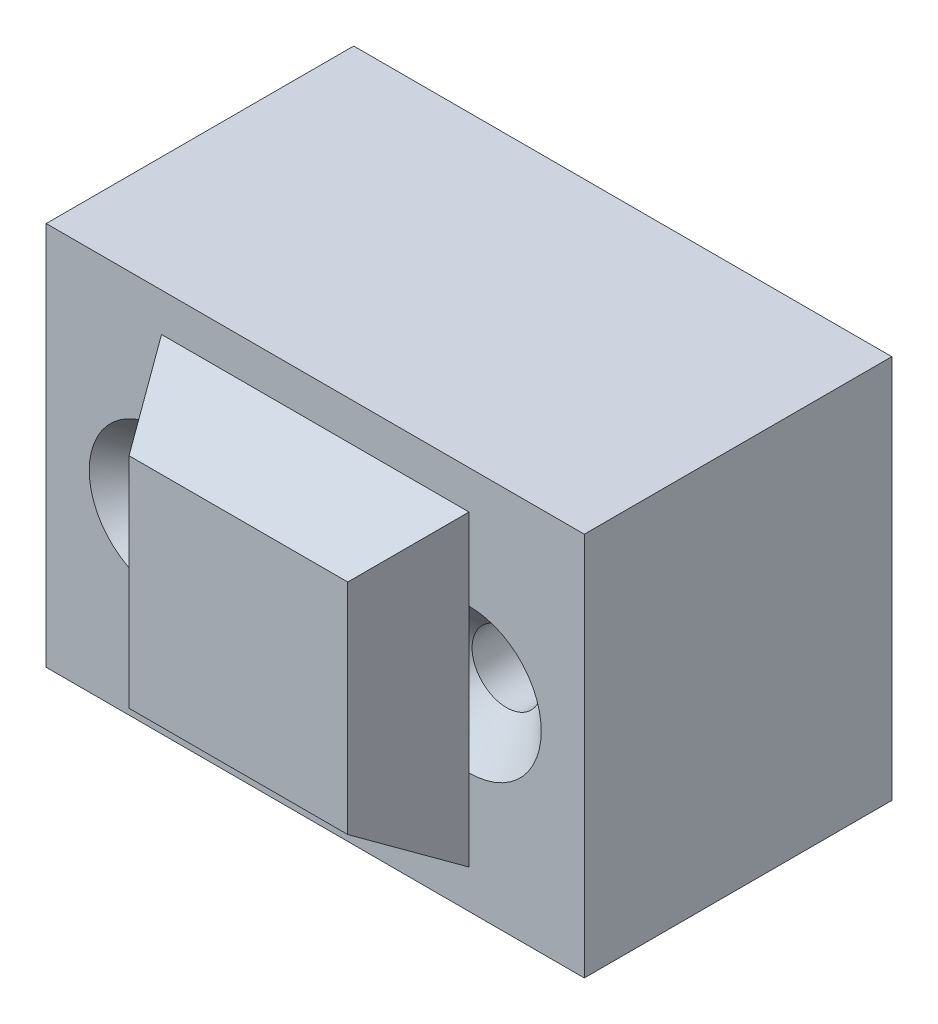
ISO-10303-21;
HEADER;
FILE_DESCRIPTION(('STEP AP214'),'2;1');
FILE_NAME('part.step','',(''),(''),'','','');
FILE_SCHEMA(('AUTOMOTIVE_DESIGN { 1 0 10303 214 1 1 1 1 }'));
ENDSEC;
DATA;
#1=APPLICATION_CONTEXT('core data for automotive mechanical design processes');
#2=APPLICATION_PROTOCOL_DEFINITION('international standard','automotive_design',2000,#1);
#3=PRODUCT_CONTEXT('',#1,'mechanical');
#4=PRODUCT('Part','Part','',(#3));
#5=PRODUCT_RELATED_PRODUCT_CATEGORY('part','',(#4));
#6=PRODUCT_DEFINITION_FORMATION('','',#4);
#7=PRODUCT_DEFINITION_CONTEXT('part definition',#1,'design');
#8=PRODUCT_DEFINITION('design','',#6,#7);
#9=PRODUCT_DEFINITION_SHAPE('','',#8);
#10=(LENGTH_UNIT() NAMED_UNIT(*) SI_UNIT(.MILLI.,.METRE.));
#11=(NAMED_UNIT(*) PLANE_ANGLE_UNIT() SI_UNIT($,.RADIAN.));
#12=(NAMED_UNIT(*) SI_UNIT($,.STERADIAN.) SOLID_ANGLE_UNIT());
#13=UNCERTAINTY_MEASURE_WITH_UNIT(LENGTH_MEASURE(1.E-05),#10,'distance_accuracy_value','');
#14=(GEOMETRIC_REPRESENTATION_CONTEXT(3) GLOBAL_UNCERTAINTY_ASSIGNED_CONTEXT((#13)) GLOBAL_UNIT_ASSIGNED_CONTEXT((#10,
#11,#12)) REPRESENTATION_CONTEXT('',''));
#15=CARTESIAN_POINT('',(0.,0.,0.));
#16=DIRECTION('',(0.,0.,1.));
#17=DIRECTION('',(1.,0.,0.));
#18=AXIS2_PLACEMENT_3D('',#15,#16,#17);
#19=CARTESIAN_POINT('',(0.,25.,20.));
#20=DIRECTION('',(0.,0.,-1.));
#21=DIRECTION('',(-1.,0.,0.));
#22=AXIS2_PLACEMENT_3D('',#19,#20,#21);
#23=PLANE('',#22);
#24=DIRECTION('',(0.,-1.,0.));
#25=VECTOR('',#24,1.);
#26=CARTESIAN_POINT('',(0.,0.,20.));
#27=LINE('',#26,#25);
#28=CARTESIAN_POINT('',(0.,25.,20.));
#29=VERTEX_POINT('',#28);
#30=CARTESIAN_POINT('',(0.,0.,20.));
#31=VERTEX_POINT('',#30);
#32=EDGE_CURVE('E167',#29,#31,#27,.T.);
#33=ORIENTED_EDGE('',*,*,#32,.T.);
#34=DIRECTION('',(1.,0.,0.));
#35=VECTOR('',#34,1.);
#36=CARTESIAN_POINT('',(0.,0.,20.));
#37=LINE('',#36,#35);
#38=CARTESIAN_POINT('',(35.,0.,20.));
#39=VERTEX_POINT('',#38);
#40=EDGE_CURVE('E170',#31,#39,#37,.T.);
#41=ORIENTED_EDGE('',*,*,#40,.T.);
#42=DIRECTION('',(0.,1.,0.));
#43=VECTOR('',#42,1.);
#44=CARTESIAN_POINT('',(35.,0.,20.));
#45=LINE('',#44,#43);
#46=CARTESIAN_POINT('',(35.,25.,20.));
#47=VERTEX_POINT('',#46);
#48=EDGE_CURVE('E173',#39,#47,#45,.T.);
#49=ORIENTED_EDGE('',*,*,#48,.T.);
#50=DIRECTION('',(-1.,0.,0.));
#51=VECTOR('',#50,1.);
#52=CARTESIAN_POINT('',(0.,25.,20.));
#53=LINE('',#52,#51);
#54=EDGE_CURVE('E175',#47,#29,#53,.T.);
#55=ORIENTED_EDGE('',*,*,#54,.T.);
#56=EDGE_LOOP('',(#33,#41,#49,#55));
#57=FACE_BOUND('',#56,.T.);
#58=DIRECTION('',(0.,-1.,0.));
#59=VECTOR('',#58,1.);
#60=CARTESIAN_POINT('',(7.5,22.5,20.));
#61=LINE('',#60,#59);
#62=CARTESIAN_POINT('',(7.5,22.5,20.));
#63=VERTEX_POINT('',#62);
#64=CARTESIAN_POINT('',(7.5,17.2,20.));
#65=VERTEX_POINT('',#64);
#66=EDGE_CURVE('E53',#63,#65,#61,.T.);
#67=ORIENTED_EDGE('',*,*,#66,.F.);
#68=DIRECTION('',(-1.,0.,0.));
#69=VECTOR('',#68,1.);
#70=CARTESIAN_POINT('',(7.5,22.5,20.));
#71=LINE('',#70,#69);
#72=CARTESIAN_POINT('',(27.5,22.5,20.));
#73=VERTEX_POINT('',#72);
#74=EDGE_CURVE('E57',#73,#63,#71,.T.);
#75=ORIENTED_EDGE('',*,*,#74,.F.);
#76=DIRECTION('',(0.,1.,0.));
#77=VECTOR('',#76,1.);
#78=CARTESIAN_POINT('',(27.5,22.5,20.));
#79=LINE('',#78,#77);
#80=CARTESIAN_POINT('',(27.5,17.2,20.));
#81=VERTEX_POINT('',#80);
#82=EDGE_CURVE('E11',#81,#73,#79,.T.);
#83=ORIENTED_EDGE('',*,*,#82,.F.);
#84=CARTESIAN_POINT('',(27.5,12.5,20.));
#85=DIRECTION('',(0.,0.,1.));
#86=DIRECTION('',(1.,0.,0.));
#87=AXIS2_PLACEMENT_3D('',#84,#85,#86);
#88=CIRCLE('',#87,4.7);
#89=CARTESIAN_POINT('',(27.5,7.8,20.));
#90=VERTEX_POINT('',#89);
#91=EDGE_CURVE('E115',#90,#81,#88,.T.);
#92=ORIENTED_EDGE('',*,*,#91,.F.);
#93=CARTESIAN_POINT('',(27.5,2.5,20.));
#94=VERTEX_POINT('',#93);
#95=EDGE_CURVE('E45',#94,#90,#79,.T.);
#96=ORIENTED_EDGE('',*,*,#95,.F.);
#97=DIRECTION('',(1.,0.,0.));
#98=VECTOR('',#97,1.);
#99=CARTESIAN_POINT('',(7.50000000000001,2.5,20.));
#100=LINE('',#99,#98);
#101=CARTESIAN_POINT('',(7.50000000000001,2.5,20.));
#102=VERTEX_POINT('',#101);
#103=EDGE_CURVE('E112',#102,#94,#100,.T.);
#104=ORIENTED_EDGE('',*,*,#103,.F.);
#105=CARTESIAN_POINT('',(7.50000000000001,7.8,20.));
#106=VERTEX_POINT('',#105);
#107=EDGE_CURVE('E43',#106,#102,#61,.T.);
#108=ORIENTED_EDGE('',*,*,#107,.F.);
#109=CARTESIAN_POINT('',(7.49999999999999,12.5,20.));
#110=DIRECTION('',(0.,0.,1.));
#111=DIRECTION('',(1.,0.,0.));
#112=AXIS2_PLACEMENT_3D('',#109,#110,#111);
#113=CIRCLE('',#112,4.7);
#114=EDGE_CURVE('E155',#65,#106,#113,.T.);
#115=ORIENTED_EDGE('',*,*,#114,.F.);
#116=EDGE_LOOP('',(#67,#75,#83,#92,#96,#104,#108,#115));
#117=FACE_BOUND('',#116,.T.);
#118=ADVANCED_FACE('F34',(#57,#117),#23,.F.);
#119=CARTESIAN_POINT('',(0.,25.,0.));
#120=DIRECTION('',(0.,0.,-1.));
#121=DIRECTION('',(-1.,0.,0.));
#122=AXIS2_PLACEMENT_3D('',#119,#120,#121);
#123=PLANE('',#122);
#124=CARTESIAN_POINT('',(7.49999999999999,12.5,0.));
#125=DIRECTION('',(0.,0.,1.));
#126=DIRECTION('',(1.,0.,0.));
#127=AXIS2_PLACEMENT_3D('',#124,#125,#126);
#128=CIRCLE('',#127,2.25);
#129=CARTESIAN_POINT('',(9.74999999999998,12.5,0.));
#130=VERTEX_POINT('',#129);
#131=EDGE_CURVE('E134',#130,#130,#128,.T.);
#132=ORIENTED_EDGE('',*,*,#131,.T.);
#133=EDGE_LOOP('',(#132));
#134=FACE_BOUND('',#133,.T.);
#135=DIRECTION('',(0.,-1.,0.));
#136=VECTOR('',#135,1.);
#137=CARTESIAN_POINT('',(0.,0.,0.));
#138=LINE('',#137,#136);
#139=CARTESIAN_POINT('',(0.,25.,0.));
#140=VERTEX_POINT('',#139);
#141=CARTESIAN_POINT('',(0.,0.,0.));
#142=VERTEX_POINT('',#141);
#143=EDGE_CURVE('E166',#140,#142,#138,.T.);
#144=ORIENTED_EDGE('',*,*,#143,.F.);
#145=DIRECTION('',(-1.,0.,0.));
#146=VECTOR('',#145,1.);
#147=CARTESIAN_POINT('',(0.,25.,0.));
#148=LINE('',#147,#146);
#149=CARTESIAN_POINT('',(35.,25.,0.));
#150=VERTEX_POINT('',#149);
#151=EDGE_CURVE('E171',#150,#140,#148,.T.);
#152=ORIENTED_EDGE('',*,*,#151,.F.);
#153=DIRECTION('',(0.,1.,0.));
#154=VECTOR('',#153,1.);
#155=CARTESIAN_POINT('',(35.,0.,0.));
#156=LINE('',#155,#154);
#157=CARTESIAN_POINT('',(35.,0.,0.));
#158=VERTEX_POINT('',#157);
#159=EDGE_CURVE('E182',#158,#150,#156,.T.);
#160=ORIENTED_EDGE('',*,*,#159,.F.);
#161=DIRECTION('',(1.,0.,0.));
#162=VECTOR('',#161,1.);
#163=CARTESIAN_POINT('',(0.,0.,0.));
#164=LINE('',#163,#162);
#165=EDGE_CURVE('E180',#142,#158,#164,.T.);
#166=ORIENTED_EDGE('',*,*,#165,.F.);
#167=EDGE_LOOP('',(#144,#152,#160,#166));
#168=FACE_BOUND('',#167,.T.);
#169=CARTESIAN_POINT('',(27.5,12.5,0.));
#170=DIRECTION('',(0.,0.,1.));
#171=DIRECTION('',(1.,0.,0.));
#172=AXIS2_PLACEMENT_3D('',#169,#170,#171);
#173=CIRCLE('',#172,2.25);
#174=CARTESIAN_POINT('',(29.75,12.5,0.));
#175=VERTEX_POINT('',#174);
#176=EDGE_CURVE('E158',#175,#175,#173,.T.);
#177=ORIENTED_EDGE('',*,*,#176,.T.);
#178=EDGE_LOOP('',(#177));
#179=FACE_BOUND('',#178,.T.);
#180=ADVANCED_FACE('F226',(#134,#168,#179),#123,.T.);
#181=CARTESIAN_POINT('',(0.,0.,20.));
#182=DIRECTION('',(1.,0.,0.));
#183=DIRECTION('',(0.,1.,0.));
#184=AXIS2_PLACEMENT_3D('',#181,#182,#183);
#185=PLANE('',#184);
#186=ORIENTED_EDGE('',*,*,#143,.T.);
#187=DIRECTION('',(0.,0.,-1.));
#188=VECTOR('',#187,1.);
#189=CARTESIAN_POINT('',(0.,0.,20.));
#190=LINE('',#189,#188);
#191=EDGE_CURVE('E38',#31,#142,#190,.T.);
#192=ORIENTED_EDGE('',*,*,#191,.F.);
#193=ORIENTED_EDGE('',*,*,#32,.F.);
#194=DIRECTION('',(0.,0.,-1.));
#195=VECTOR('',#194,1.);
#196=CARTESIAN_POINT('',(0.,25.,20.));
#197=LINE('',#196,#195);
#198=EDGE_CURVE('E177',#29,#140,#197,.T.);
#199=ORIENTED_EDGE('',*,*,#198,.T.);
#200=EDGE_LOOP('',(#186,#192,#193,#199));
#201=FACE_BOUND('',#200,.T.);
#202=ADVANCED_FACE('F36',(#201),#185,.F.);
#203=CARTESIAN_POINT('',(0.,0.,20.));
#204=DIRECTION('',(0.,1.,0.));
#205=DIRECTION('',(0.,0.,1.));
#206=AXIS2_PLACEMENT_3D('',#203,#204,#205);
#207=PLANE('',#206);
#208=ORIENTED_EDGE('',*,*,#165,.T.);
#209=DIRECTION('',(0.,0.,-1.));
#210=VECTOR('',#209,1.);
#211=CARTESIAN_POINT('',(35.,0.,20.));
#212=LINE('',#211,#210);
#213=EDGE_CURVE('E189',#39,#158,#212,.T.);
#214=ORIENTED_EDGE('',*,*,#213,.F.);
#215=ORIENTED_EDGE('',*,*,#40,.F.);
#216=ORIENTED_EDGE('',*,*,#191,.T.);
#217=EDGE_LOOP('',(#208,#214,#215,#216));
#218=FACE_BOUND('',#217,.T.);
#219=ADVANCED_FACE('F242',(#218),#207,.F.);
#220=CARTESIAN_POINT('',(35.,0.,20.));
#221=DIRECTION('',(-1.,0.,0.));
#222=DIRECTION('',(0.,-1.,0.));
#223=AXIS2_PLACEMENT_3D('',#220,#221,#222);
#224=PLANE('',#223);
#225=ORIENTED_EDGE('',*,*,#159,.T.);
#226=DIRECTION('',(0.,0.,-1.));
#227=VECTOR('',#226,1.);
#228=CARTESIAN_POINT('',(35.,25.,20.));
#229=LINE('',#228,#227);
#230=EDGE_CURVE('E187',#47,#150,#229,.T.);
#231=ORIENTED_EDGE('',*,*,#230,.F.);
#232=ORIENTED_EDGE('',*,*,#48,.F.);
#233=ORIENTED_EDGE('',*,*,#213,.T.);
#234=EDGE_LOOP('',(#225,#231,#232,#233));
#235=FACE_BOUND('',#234,.T.);
#236=ADVANCED_FACE('F239',(#235),#224,.F.);
#237=CARTESIAN_POINT('',(0.,25.,20.));
#238=DIRECTION('',(0.,-1.,0.));
#239=DIRECTION('',(0.,0.,-1.));
#240=AXIS2_PLACEMENT_3D('',#237,#238,#239);
#241=PLANE('',#240);
#242=ORIENTED_EDGE('',*,*,#151,.T.);
#243=ORIENTED_EDGE('',*,*,#198,.F.);
#244=ORIENTED_EDGE('',*,*,#54,.F.);
#245=ORIENTED_EDGE('',*,*,#230,.T.);
#246=EDGE_LOOP('',(#242,#243,#244,#245));
#247=FACE_BOUND('',#246,.T.);
#248=ADVANCED_FACE('F236',(#247),#241,.F.);
#249=CARTESIAN_POINT('',(27.5,12.5,20.));
#250=DIRECTION('',(0.,0.,1.));
#251=DIRECTION('',(1.,0.,0.));
#252=AXIS2_PLACEMENT_3D('',#249,#250,#251);
#253=CONICAL_SURFACE('',#252,4.7,0.785398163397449);
#254=CARTESIAN_POINT('',(27.5,12.5,17.55));
#255=DIRECTION('',(0.,0.,1.));
#256=DIRECTION('',(1.,0.,0.));
#257=AXIS2_PLACEMENT_3D('',#254,#255,#256);
#258=CIRCLE('',#257,2.25);
#259=CARTESIAN_POINT('',(29.75,12.5,17.55));
#260=VERTEX_POINT('',#259);
#261=EDGE_CURVE('E161',#260,#260,#258,.T.);
#262=ORIENTED_EDGE('',*,*,#261,.F.);
#263=EDGE_LOOP('',(#262));
#264=FACE_BOUND('',#263,.T.);
#265=EDGE_CURVE('E164',#81,#90,#88,.T.);
#266=ORIENTED_EDGE('',*,*,#265,.T.);
#267=ORIENTED_EDGE('',*,*,#91,.T.);
#268=EDGE_LOOP('',(#266,#267));
#269=FACE_BOUND('',#268,.T.);
#270=ADVANCED_FACE('F221',(#264,#269),#253,.F.);
#271=CARTESIAN_POINT('',(27.5,12.5,20.));
#272=DIRECTION('',(0.,0.,1.));
#273=DIRECTION('',(1.,0.,0.));
#274=AXIS2_PLACEMENT_3D('',#271,#272,#273);
#275=CYLINDRICAL_SURFACE('',#274,2.25);
#276=ORIENTED_EDGE('',*,*,#176,.F.);
#277=EDGE_LOOP('',(#276));
#278=FACE_BOUND('',#277,.T.);
#279=ORIENTED_EDGE('',*,*,#261,.T.);
#280=EDGE_LOOP('',(#279));
#281=FACE_BOUND('',#280,.T.);
#282=ADVANCED_FACE('F212',(#278,#281),#275,.F.);
#283=CARTESIAN_POINT('',(7.49999999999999,12.5,20.));
#284=DIRECTION('',(0.,0.,1.));
#285=DIRECTION('',(1.,0.,0.));
#286=AXIS2_PLACEMENT_3D('',#283,#284,#285);
#287=CONICAL_SURFACE('',#286,4.7,0.785398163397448);
#288=CARTESIAN_POINT('',(7.49999999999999,12.5,17.55));
#289=DIRECTION('',(0.,0.,1.));
#290=DIRECTION('',(1.,0.,0.));
#291=AXIS2_PLACEMENT_3D('',#288,#289,#290);
#292=CIRCLE('',#291,2.25);
#293=CARTESIAN_POINT('',(9.74999999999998,12.5,17.55));
#294=VERTEX_POINT('',#293);
#295=EDGE_CURVE('E151',#294,#294,#292,.T.);
#296=ORIENTED_EDGE('',*,*,#295,.F.);
#297=EDGE_LOOP('',(#296));
#298=FACE_BOUND('',#297,.T.);
#299=ORIENTED_EDGE('',*,*,#114,.T.);
#300=EDGE_CURVE('E154',#106,#65,#113,.T.);
#301=ORIENTED_EDGE('',*,*,#300,.T.);
#302=EDGE_LOOP('',(#299,#301));
#303=FACE_BOUND('',#302,.T.);
#304=ADVANCED_FACE('F209',(#298,#303),#287,.F.);
#305=CARTESIAN_POINT('',(7.49999999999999,12.5,20.));
#306=DIRECTION('',(0.,0.,1.));
#307=DIRECTION('',(1.,0.,0.));
#308=AXIS2_PLACEMENT_3D('',#305,#306,#307);
#309=CYLINDRICAL_SURFACE('',#308,2.25);
#310=ORIENTED_EDGE('',*,*,#131,.F.);
#311=EDGE_LOOP('',(#310));
#312=FACE_BOUND('',#311,.T.);
#313=ORIENTED_EDGE('',*,*,#295,.T.);
#314=EDGE_LOOP('',(#313));
#315=FACE_BOUND('',#314,.T.);
#316=ADVANCED_FACE('F211',(#312,#315),#309,.F.);
#317=CARTESIAN_POINT('',(7.50000000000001,2.5,20.));
#318=DIRECTION('',(0.,0.,1.));
#319=DIRECTION('',(1.,0.,0.));
#320=AXIS2_PLACEMENT_3D('',#317,#318,#319);
#321=PLANE('',#320);
#322=ORIENTED_EDGE('',*,*,#300,.F.);
#323=EDGE_CURVE('E199',#65,#106,#61,.T.);
#324=ORIENTED_EDGE('',*,*,#323,.F.);
#325=EDGE_LOOP('',(#322,#324));
#326=FACE_BOUND('',#325,.T.);
#327=ADVANCED_FACE('F207',(#326),#321,.F.);
#328=CARTESIAN_POINT('',(7.5,22.5,20.));
#329=DIRECTION('',(-0.866025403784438,0.,0.500000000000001));
#330=DIRECTION('',(0.500000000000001,0.,0.866025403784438));
#331=AXIS2_PLACEMENT_3D('',#328,#329,#330);
#332=PLANE('',#331);
#333=ORIENTED_EDGE('',*,*,#66,.T.);
#334=ORIENTED_EDGE('',*,*,#323,.T.);
#335=ORIENTED_EDGE('',*,*,#107,.T.);
#336=DIRECTION('',(-0.447213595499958,-0.447213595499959,-0.774596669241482));
#337=VECTOR('',#336,1.);
#338=CARTESIAN_POINT('',(7.50000000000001,2.5,20.));
#339=LINE('',#338,#337);
#340=CARTESIAN_POINT('',(10.3867513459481,5.38675134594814,25.));
#341=VERTEX_POINT('',#340);
#342=EDGE_CURVE('E127',#341,#102,#339,.T.);
#343=ORIENTED_EDGE('',*,*,#342,.F.);
#344=DIRECTION('',(0.,1.,0.));
#345=VECTOR('',#344,1.);
#346=CARTESIAN_POINT('',(10.3867513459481,22.5,25.));
#347=LINE('',#346,#345);
#348=CARTESIAN_POINT('',(10.3867513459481,19.6132486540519,25.));
#349=VERTEX_POINT('',#348);
#350=EDGE_CURVE('E141',#349,#341,#347,.F.);
#351=ORIENTED_EDGE('',*,*,#350,.F.);
#352=DIRECTION('',(-0.447213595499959,0.447213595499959,-0.774596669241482));
#353=VECTOR('',#352,1.);
#354=CARTESIAN_POINT('',(7.5,22.5,20.));
#355=LINE('',#354,#353);
#356=EDGE_CURVE('E137',#349,#63,#355,.T.);
#357=ORIENTED_EDGE('',*,*,#356,.T.);
#358=EDGE_LOOP('',(#333,#334,#335,#343,#351,#357));
#359=FACE_BOUND('',#358,.T.);
#360=ADVANCED_FACE('F203',(#359),#332,.T.);
#361=CARTESIAN_POINT('',(7.50000000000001,2.5,20.));
#362=DIRECTION('',(0.,-0.866025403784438,0.500000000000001));
#363=DIRECTION('',(0.,-0.500000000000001,-0.866025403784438));
#364=AXIS2_PLACEMENT_3D('',#361,#362,#363);
#365=PLANE('',#364);
#366=ORIENTED_EDGE('',*,*,#103,.T.);
#367=DIRECTION('',(0.447213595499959,-0.447213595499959,-0.774596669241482));
#368=VECTOR('',#367,1.);
#369=CARTESIAN_POINT('',(23.5,6.50000000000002,26.9282032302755));
#370=LINE('',#369,#368);
#371=CARTESIAN_POINT('',(24.6132486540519,5.38675134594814,25.));
#372=VERTEX_POINT('',#371);
#373=EDGE_CURVE('E124',#372,#94,#370,.T.);
#374=ORIENTED_EDGE('',*,*,#373,.F.);
#375=DIRECTION('',(-1.,0.,0.));
#376=VECTOR('',#375,1.);
#377=CARTESIAN_POINT('',(7.50000000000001,5.38675134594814,25.));
#378=LINE('',#377,#376);
#379=EDGE_CURVE('E144',#341,#372,#378,.F.);
#380=ORIENTED_EDGE('',*,*,#379,.F.);
#381=ORIENTED_EDGE('',*,*,#342,.T.);
#382=EDGE_LOOP('',(#366,#374,#380,#381));
#383=FACE_BOUND('',#382,.T.);
#384=ADVANCED_FACE('F123',(#383),#365,.T.);
#385=CARTESIAN_POINT('',(27.5,22.5,20.));
#386=DIRECTION('',(0.866025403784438,0.,0.500000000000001));
#387=DIRECTION('',(0.500000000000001,0.,-0.866025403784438));
#388=AXIS2_PLACEMENT_3D('',#385,#386,#387);
#389=PLANE('',#388);
#390=ORIENTED_EDGE('',*,*,#95,.T.);
#391=EDGE_CURVE('E46',#90,#81,#79,.T.);
#392=ORIENTED_EDGE('',*,*,#391,.T.);
#393=ORIENTED_EDGE('',*,*,#82,.T.);
#394=DIRECTION('',(0.447213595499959,0.447213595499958,-0.774596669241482));
#395=VECTOR('',#394,1.);
#396=CARTESIAN_POINT('',(23.5,18.5,26.9282032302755));
#397=LINE('',#396,#395);
#398=CARTESIAN_POINT('',(24.6132486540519,19.6132486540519,25.));
#399=VERTEX_POINT('',#398);
#400=EDGE_CURVE('E132',#399,#73,#397,.T.);
#401=ORIENTED_EDGE('',*,*,#400,.F.);
#402=DIRECTION('',(0.,-1.,0.));
#403=VECTOR('',#402,1.);
#404=CARTESIAN_POINT('',(24.6132486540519,22.5,25.));
#405=LINE('',#404,#403);
#406=EDGE_CURVE('E131',#372,#399,#405,.F.);
#407=ORIENTED_EDGE('',*,*,#406,.F.);
#408=ORIENTED_EDGE('',*,*,#373,.T.);
#409=EDGE_LOOP('',(#390,#392,#393,#401,#407,#408));
#410=FACE_BOUND('',#409,.T.);
#411=ADVANCED_FACE('F129',(#410),#389,.T.);
#412=CARTESIAN_POINT('',(7.5,22.5,20.));
#413=DIRECTION('',(0.,0.866025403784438,0.500000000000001));
#414=DIRECTION('',(0.,-0.500000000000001,0.866025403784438));
#415=AXIS2_PLACEMENT_3D('',#412,#413,#414);
#416=PLANE('',#415);
#417=ORIENTED_EDGE('',*,*,#74,.T.);
#418=ORIENTED_EDGE('',*,*,#356,.F.);
#419=DIRECTION('',(1.,0.,0.));
#420=VECTOR('',#419,1.);
#421=CARTESIAN_POINT('',(7.5,19.6132486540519,25.));
#422=LINE('',#421,#420);
#423=EDGE_CURVE('E147',#399,#349,#422,.F.);
#424=ORIENTED_EDGE('',*,*,#423,.F.);
#425=ORIENTED_EDGE('',*,*,#400,.T.);
#426=EDGE_LOOP('',(#417,#418,#424,#425));
#427=FACE_BOUND('',#426,.T.);
#428=ADVANCED_FACE('F271',(#427),#416,.T.);
#429=CARTESIAN_POINT('',(7.50000000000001,2.5,25.));
#430=DIRECTION('',(0.,0.,1.));
#431=DIRECTION('',(1.,0.,0.));
#432=AXIS2_PLACEMENT_3D('',#429,#430,#431);
#433=PLANE('',#432);
#434=ORIENTED_EDGE('',*,*,#350,.T.);
#435=ORIENTED_EDGE('',*,*,#379,.T.);
#436=ORIENTED_EDGE('',*,*,#406,.T.);
#437=ORIENTED_EDGE('',*,*,#423,.T.);
#438=EDGE_LOOP('',(#434,#435,#436,#437));
#439=FACE_BOUND('',#438,.T.);
#440=ADVANCED_FACE('F273',(#439),#433,.T.);
#441=ORIENTED_EDGE('',*,*,#265,.F.);
#442=ORIENTED_EDGE('',*,*,#391,.F.);
#443=EDGE_LOOP('',(#441,#442));
#444=FACE_BOUND('',#443,.T.);
#445=ADVANCED_FACE('F265',(#444),#321,.F.);
#446=CLOSED_SHELL('',(#118,#180,#202,#219,#236,#248,#270,#282,#304,#316,#327,#360,#384,#411,
#428,#440,#445));
#447=MANIFOLD_SOLID_BREP('B2',#446);
#448=ADVANCED_BREP_SHAPE_REPRESENTATION('',(#18,#447),#14);
#449=SHAPE_DEFINITION_REPRESENTATION(#9,#448);
ENDSEC;
END-ISO-10303-21;
